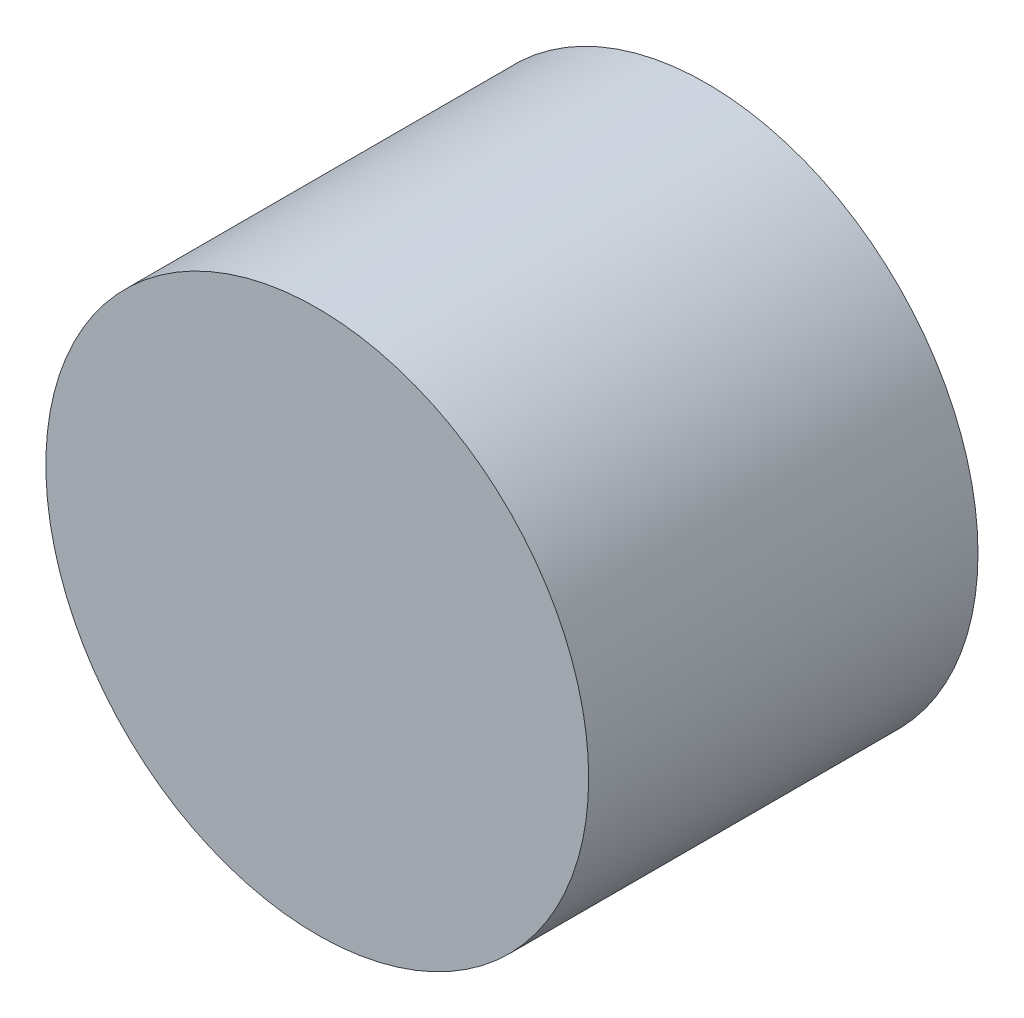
ISO-10303-21;
HEADER;
FILE_DESCRIPTION(('STEP AP214'),'2;1');
FILE_NAME('part.step','',(''),(''),'','','');
FILE_SCHEMA(('AUTOMOTIVE_DESIGN { 1 0 10303 214 1 1 1 1 }'));
ENDSEC;
DATA;
#1=APPLICATION_CONTEXT('core data for automotive mechanical design processes');
#2=APPLICATION_PROTOCOL_DEFINITION('international standard','automotive_design',2000,#1);
#3=PRODUCT_CONTEXT('',#1,'mechanical');
#4=PRODUCT('Part','Part','',(#3));
#5=PRODUCT_RELATED_PRODUCT_CATEGORY('part','',(#4));
#6=PRODUCT_DEFINITION_FORMATION('','',#4);
#7=PRODUCT_DEFINITION_CONTEXT('part definition',#1,'design');
#8=PRODUCT_DEFINITION('design','',#6,#7);
#9=PRODUCT_DEFINITION_SHAPE('','',#8);
#10=(LENGTH_UNIT() NAMED_UNIT(*) SI_UNIT(.MILLI.,.METRE.));
#11=(NAMED_UNIT(*) PLANE_ANGLE_UNIT() SI_UNIT($,.RADIAN.));
#12=(NAMED_UNIT(*) SI_UNIT($,.STERADIAN.) SOLID_ANGLE_UNIT());
#13=UNCERTAINTY_MEASURE_WITH_UNIT(LENGTH_MEASURE(1.E-05),#10,'distance_accuracy_value','');
#14=(GEOMETRIC_REPRESENTATION_CONTEXT(3) GLOBAL_UNCERTAINTY_ASSIGNED_CONTEXT((#13)) GLOBAL_UNIT_ASSIGNED_CONTEXT((#10,
#11,#12)) REPRESENTATION_CONTEXT('',''));
#15=CARTESIAN_POINT('',(0.,0.,0.));
#16=DIRECTION('',(0.,0.,1.));
#17=DIRECTION('',(1.,0.,0.));
#18=AXIS2_PLACEMENT_3D('',#15,#16,#17);
#19=CARTESIAN_POINT('',(0.,0.,7.1));
#20=DIRECTION('',(0.,0.,-1.));
#21=DIRECTION('',(-1.,0.,0.));
#22=AXIS2_PLACEMENT_3D('',#19,#20,#21);
#23=CYLINDRICAL_SURFACE('',#22,4.95);
#24=CARTESIAN_POINT('',(0.,0.,7.1));
#25=DIRECTION('',(0.,0.,1.));
#26=DIRECTION('',(1.,0.,0.));
#27=AXIS2_PLACEMENT_3D('',#24,#25,#26);
#28=CIRCLE('',#27,4.95);
#29=CARTESIAN_POINT('',(4.95,0.,7.1));
#30=VERTEX_POINT('',#29);
#31=EDGE_CURVE('E10',#30,#30,#28,.T.);
#32=ORIENTED_EDGE('',*,*,#31,.F.);
#33=EDGE_LOOP('',(#32));
#34=FACE_BOUND('',#33,.T.);
#35=CARTESIAN_POINT('',(0.,0.,0.));
#36=DIRECTION('',(0.,0.,1.));
#37=DIRECTION('',(1.,0.,0.));
#38=AXIS2_PLACEMENT_3D('',#35,#36,#37);
#39=CIRCLE('',#38,4.95);
#40=CARTESIAN_POINT('',(4.95,0.,0.));
#41=VERTEX_POINT('',#40);
#42=EDGE_CURVE('E44',#41,#41,#39,.T.);
#43=ORIENTED_EDGE('',*,*,#42,.T.);
#44=EDGE_LOOP('',(#43));
#45=FACE_BOUND('',#44,.T.);
#46=ADVANCED_FACE('F41',(#34,#45),#23,.T.);
#47=CARTESIAN_POINT('',(0.,0.,7.1));
#48=DIRECTION('',(0.,0.,1.));
#49=DIRECTION('',(1.,0.,0.));
#50=AXIS2_PLACEMENT_3D('',#47,#48,#49);
#51=PLANE('',#50);
#52=ORIENTED_EDGE('',*,*,#31,.T.);
#53=EDGE_LOOP('',(#52));
#54=FACE_BOUND('',#53,.T.);
#55=ADVANCED_FACE('F56',(#54),#51,.T.);
#56=CARTESIAN_POINT('',(0.,0.,0.));
#57=DIRECTION('',(0.,0.,1.));
#58=DIRECTION('',(1.,0.,0.));
#59=AXIS2_PLACEMENT_3D('',#56,#57,#58);
#60=PLANE('',#59);
#61=ORIENTED_EDGE('',*,*,#42,.F.);
#62=EDGE_LOOP('',(#61));
#63=FACE_BOUND('',#62,.T.);
#64=ADVANCED_FACE('F54',(#63),#60,.F.);
#65=CLOSED_SHELL('',(#46,#55,#64));
#66=MANIFOLD_SOLID_BREP('B2',#65);
#67=ADVANCED_BREP_SHAPE_REPRESENTATION('',(#18,#66),#14);
#68=SHAPE_DEFINITION_REPRESENTATION(#9,#67);
ENDSEC;
END-ISO-10303-21;
